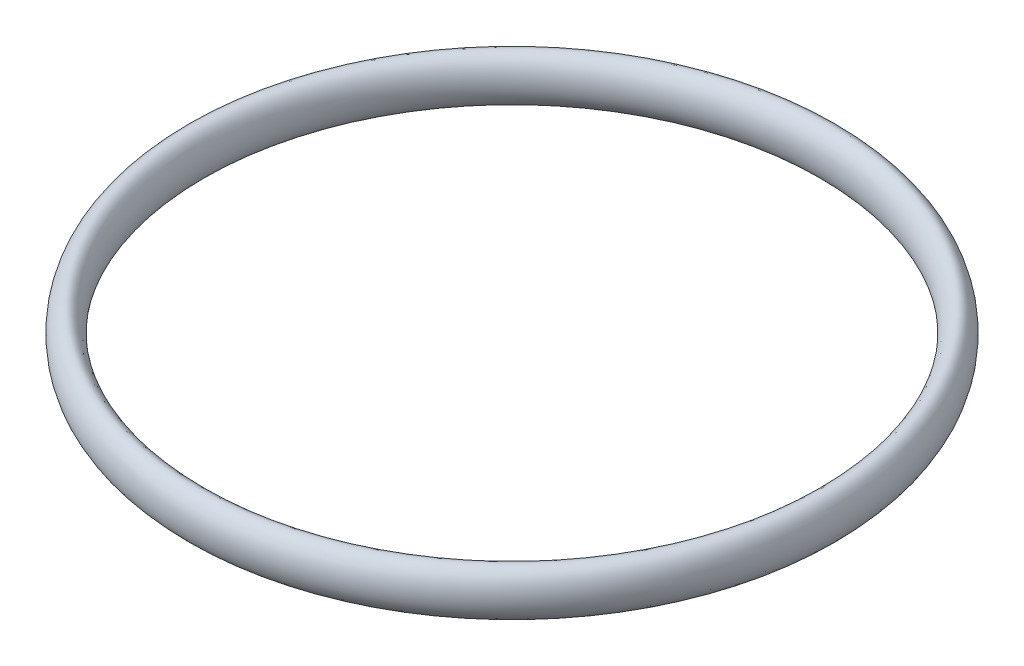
ISO-10303-21;
HEADER;
FILE_DESCRIPTION(('STEP AP214'),'2;1');
FILE_NAME('part.step','',(''),(''),'','','');
FILE_SCHEMA(('AUTOMOTIVE_DESIGN { 1 0 10303 214 1 1 1 1 }'));
ENDSEC;
DATA;
#1=APPLICATION_CONTEXT('core data for automotive mechanical design processes');
#2=APPLICATION_PROTOCOL_DEFINITION('international standard','automotive_design',2000,#1);
#3=PRODUCT_CONTEXT('',#1,'mechanical');
#4=PRODUCT('Part','Part','',(#3));
#5=PRODUCT_RELATED_PRODUCT_CATEGORY('part','',(#4));
#6=PRODUCT_DEFINITION_FORMATION('','',#4);
#7=PRODUCT_DEFINITION_CONTEXT('part definition',#1,'design');
#8=PRODUCT_DEFINITION('design','',#6,#7);
#9=PRODUCT_DEFINITION_SHAPE('','',#8);
#10=(LENGTH_UNIT() NAMED_UNIT(*) SI_UNIT(.MILLI.,.METRE.));
#11=(NAMED_UNIT(*) PLANE_ANGLE_UNIT() SI_UNIT($,.RADIAN.));
#12=(NAMED_UNIT(*) SI_UNIT($,.STERADIAN.) SOLID_ANGLE_UNIT());
#13=UNCERTAINTY_MEASURE_WITH_UNIT(LENGTH_MEASURE(1.E-05),#10,'distance_accuracy_value','');
#14=(GEOMETRIC_REPRESENTATION_CONTEXT(3) GLOBAL_UNCERTAINTY_ASSIGNED_CONTEXT((#13)) GLOBAL_UNIT_ASSIGNED_CONTEXT((#10,
#11,#12)) REPRESENTATION_CONTEXT('',''));
#15=CARTESIAN_POINT('',(0.,0.,0.));
#16=DIRECTION('',(0.,0.,1.));
#17=DIRECTION('',(1.,0.,0.));
#18=AXIS2_PLACEMENT_3D('',#15,#16,#17);
#19=CARTESIAN_POINT('',(-64.58,-4.75,0.));
#20=DIRECTION('',(0.,0.,1.));
#21=DIRECTION('',(0.,1.,0.));
#22=AXIS2_PLACEMENT_3D('',#19,#20,#21);
#23=ELLIPSE('',#22,4.75,2.92000000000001);
#24=CARTESIAN_POINT('',(0.,51.6737551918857,0.));
#25=DIRECTION('',(0.,1.,0.));
#26=AXIS1_PLACEMENT('',#24,#25);
#27=SURFACE_OF_REVOLUTION('',#23,#26);
#28=ADVANCED_FACE('F439',(),#27,.F.);
#29=CLOSED_SHELL('',(#28));
#30=MANIFOLD_SOLID_BREP('B2',#29);
#31=ADVANCED_BREP_SHAPE_REPRESENTATION('',(#18,#30),#14);
#32=SHAPE_DEFINITION_REPRESENTATION(#9,#31);
ENDSEC;
END-ISO-10303-21;
